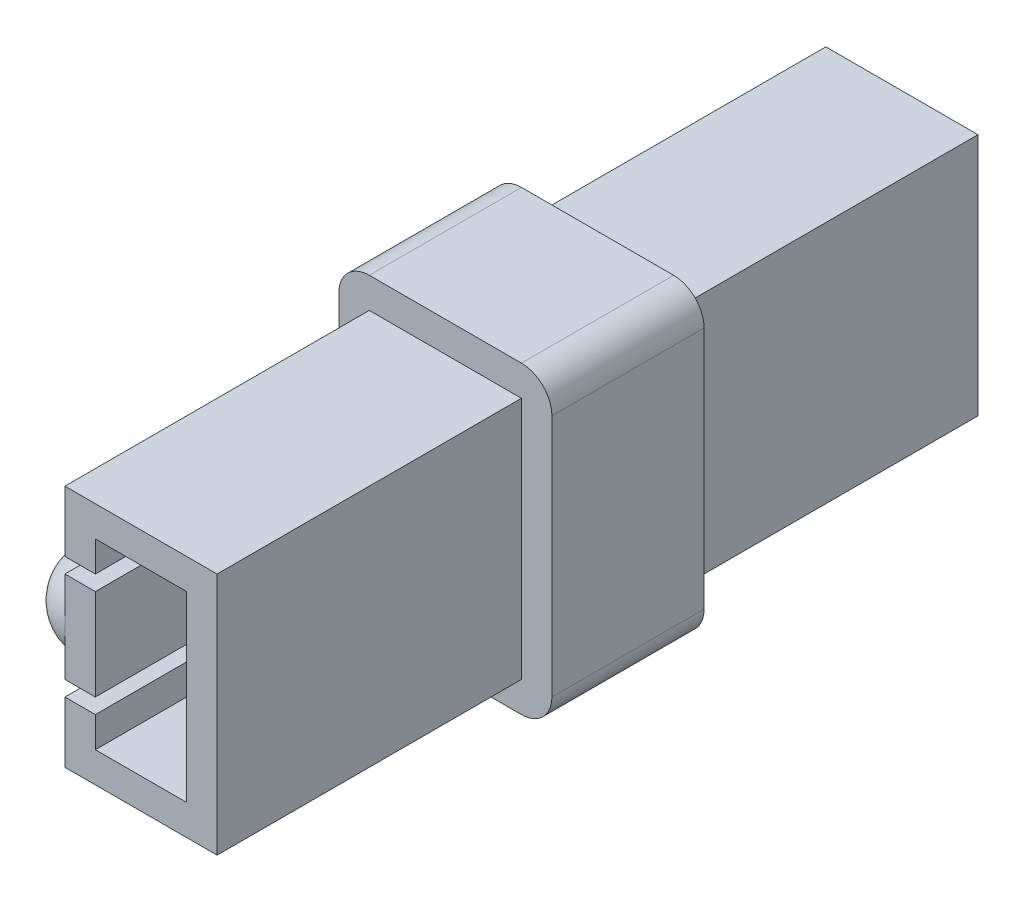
ISO-10303-21;
HEADER;
FILE_DESCRIPTION(('STEP AP214'),'2;1');
FILE_NAME('part.step','',(''),(''),'','','');
FILE_SCHEMA(('AUTOMOTIVE_DESIGN { 1 0 10303 214 1 1 1 1 }'));
ENDSEC;
DATA;
#1=APPLICATION_CONTEXT('core data for automotive mechanical design processes');
#2=APPLICATION_PROTOCOL_DEFINITION('international standard','automotive_design',2000,#1);
#3=PRODUCT_CONTEXT('',#1,'mechanical');
#4=PRODUCT('Part','Part','',(#3));
#5=PRODUCT_RELATED_PRODUCT_CATEGORY('part','',(#4));
#6=PRODUCT_DEFINITION_FORMATION('','',#4);
#7=PRODUCT_DEFINITION_CONTEXT('part definition',#1,'design');
#8=PRODUCT_DEFINITION('design','',#6,#7);
#9=PRODUCT_DEFINITION_SHAPE('','',#8);
#10=(LENGTH_UNIT() NAMED_UNIT(*) SI_UNIT(.MILLI.,.METRE.));
#11=(NAMED_UNIT(*) PLANE_ANGLE_UNIT() SI_UNIT($,.RADIAN.));
#12=(NAMED_UNIT(*) SI_UNIT($,.STERADIAN.) SOLID_ANGLE_UNIT());
#13=UNCERTAINTY_MEASURE_WITH_UNIT(LENGTH_MEASURE(1.E-05),#10,'distance_accuracy_value','');
#14=(GEOMETRIC_REPRESENTATION_CONTEXT(3) GLOBAL_UNCERTAINTY_ASSIGNED_CONTEXT((#13)) GLOBAL_UNIT_ASSIGNED_CONTEXT((#10,
#11,#12)) REPRESENTATION_CONTEXT('',''));
#15=CARTESIAN_POINT('',(0.,0.,0.));
#16=DIRECTION('',(0.,0.,1.));
#17=DIRECTION('',(1.,0.,0.));
#18=AXIS2_PLACEMENT_3D('',#15,#16,#17);
#19=CARTESIAN_POINT('',(-2.5,4.,-12.5));
#20=DIRECTION('',(0.,0.,-1.));
#21=DIRECTION('',(-1.,0.,0.));
#22=AXIS2_PLACEMENT_3D('',#19,#20,#21);
#23=PLANE('',#22);
#24=DIRECTION('',(0.,-1.,0.));
#25=VECTOR('',#24,1.);
#26=CARTESIAN_POINT('',(-1.5,-3.,-12.5));
#27=LINE('',#26,#25);
#28=CARTESIAN_POINT('',(-1.5,1.5,-12.5));
#29=VERTEX_POINT('',#28);
#30=CARTESIAN_POINT('',(-1.5,-1.5,-12.5));
#31=VERTEX_POINT('',#30);
#32=EDGE_CURVE('E346',#29,#31,#27,.T.);
#33=ORIENTED_EDGE('',*,*,#32,.T.);
#34=DIRECTION('',(-1.,0.,0.));
#35=VECTOR('',#34,1.);
#36=CARTESIAN_POINT('',(-1.5,-1.5,-12.5));
#37=LINE('',#36,#35);
#38=CARTESIAN_POINT('',(-2.5,-1.5,-12.5));
#39=VERTEX_POINT('',#38);
#40=EDGE_CURVE('E443',#31,#39,#37,.T.);
#41=ORIENTED_EDGE('',*,*,#40,.T.);
#42=DIRECTION('',(0.,-1.,0.));
#43=VECTOR('',#42,1.);
#44=CARTESIAN_POINT('',(-2.5,-4.,-12.5));
#45=LINE('',#44,#43);
#46=CARTESIAN_POINT('',(-2.5,0.,-12.5));
#47=VERTEX_POINT('',#46);
#48=EDGE_CURVE('E460',#47,#39,#45,.T.);
#49=ORIENTED_EDGE('',*,*,#48,.F.);
#50=CARTESIAN_POINT('',(-2.5,1.5,-12.5));
#51=VERTEX_POINT('',#50);
#52=EDGE_CURVE('E459',#51,#47,#45,.T.);
#53=ORIENTED_EDGE('',*,*,#52,.F.);
#54=DIRECTION('',(-1.,0.,0.));
#55=VECTOR('',#54,1.);
#56=CARTESIAN_POINT('',(-1.5,1.5,-12.5));
#57=LINE('',#56,#55);
#58=EDGE_CURVE('E441',#29,#51,#57,.T.);
#59=ORIENTED_EDGE('',*,*,#58,.F.);
#60=EDGE_LOOP('',(#33,#41,#49,#53,#59));
#61=FACE_BOUND('',#60,.T.);
#62=ADVANCED_FACE('F36',(#61),#23,.T.);
#63=CARTESIAN_POINT('',(-2.5,4.,12.5));
#64=DIRECTION('',(0.,0.,-1.));
#65=DIRECTION('',(-1.,0.,0.));
#66=AXIS2_PLACEMENT_3D('',#63,#64,#65);
#67=PLANE('',#66);
#68=DIRECTION('',(-1.,0.,0.));
#69=VECTOR('',#68,1.);
#70=CARTESIAN_POINT('',(-1.5,-1.5,12.5));
#71=LINE('',#70,#69);
#72=CARTESIAN_POINT('',(-1.5,-1.5,12.5));
#73=VERTEX_POINT('',#72);
#74=CARTESIAN_POINT('',(-2.5,-1.5,12.5));
#75=VERTEX_POINT('',#74);
#76=EDGE_CURVE('E397',#73,#75,#71,.T.);
#77=ORIENTED_EDGE('',*,*,#76,.F.);
#78=DIRECTION('',(0.,-1.,0.));
#79=VECTOR('',#78,1.);
#80=CARTESIAN_POINT('',(-1.5,-3.,12.5));
#81=LINE('',#80,#79);
#82=CARTESIAN_POINT('',(-1.5,1.5,12.5));
#83=VERTEX_POINT('',#82);
#84=EDGE_CURVE('E313',#83,#73,#81,.T.);
#85=ORIENTED_EDGE('',*,*,#84,.F.);
#86=DIRECTION('',(-1.,0.,0.));
#87=VECTOR('',#86,1.);
#88=CARTESIAN_POINT('',(-1.5,1.5,12.5));
#89=LINE('',#88,#87);
#90=CARTESIAN_POINT('',(-2.5,1.5,12.5));
#91=VERTEX_POINT('',#90);
#92=EDGE_CURVE('E401',#83,#91,#89,.T.);
#93=ORIENTED_EDGE('',*,*,#92,.T.);
#94=DIRECTION('',(0.,-1.,0.));
#95=VECTOR('',#94,1.);
#96=CARTESIAN_POINT('',(-2.5,-4.,12.5));
#97=LINE('',#96,#95);
#98=CARTESIAN_POINT('',(-2.5,0.,12.5));
#99=VERTEX_POINT('',#98);
#100=EDGE_CURVE('E474',#91,#99,#97,.T.);
#101=ORIENTED_EDGE('',*,*,#100,.T.);
#102=EDGE_CURVE('E475',#99,#75,#97,.T.);
#103=ORIENTED_EDGE('',*,*,#102,.T.);
#104=EDGE_LOOP('',(#77,#85,#93,#101,#103));
#105=FACE_BOUND('',#104,.T.);
#106=ADVANCED_FACE('F611',(#105),#67,.F.);
#107=CARTESIAN_POINT('',(-2.5,-4.,12.5));
#108=DIRECTION('',(1.,0.,0.));
#109=DIRECTION('',(0.,0.,-1.));
#110=AXIS2_PLACEMENT_3D('',#107,#108,#109);
#111=PLANE('',#110);
#112=CARTESIAN_POINT('',(-2.5,0.,11.));
#113=DIRECTION('',(1.,0.,0.));
#114=DIRECTION('',(0.,0.,1.));
#115=AXIS2_PLACEMENT_3D('',#112,#113,#114);
#116=CIRCLE('',#115,1.5);
#117=CARTESIAN_POINT('',(-2.49999999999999,-1.5,11.));
#118=VERTEX_POINT('',#117);
#119=EDGE_CURVE('E361',#99,#118,#116,.T.);
#120=ORIENTED_EDGE('',*,*,#119,.T.);
#121=DIRECTION('',(0.,0.,-1.));
#122=VECTOR('',#121,1.);
#123=CARTESIAN_POINT('',(-2.5,-1.5,12.5));
#124=LINE('',#123,#122);
#125=EDGE_CURVE('E370',#75,#118,#124,.T.);
#126=ORIENTED_EDGE('',*,*,#125,.F.);
#127=ORIENTED_EDGE('',*,*,#102,.F.);
#128=EDGE_LOOP('',(#120,#126,#127));
#129=FACE_BOUND('',#128,.T.);
#130=ADVANCED_FACE('F618',(#129),#111,.F.);
#131=CARTESIAN_POINT('',(-2.5,1.5,11.));
#132=VERTEX_POINT('',#131);
#133=EDGE_CURVE('E52',#132,#99,#116,.T.);
#134=ORIENTED_EDGE('',*,*,#133,.T.);
#135=ORIENTED_EDGE('',*,*,#100,.F.);
#136=DIRECTION('',(0.,0.,1.));
#137=VECTOR('',#136,1.);
#138=CARTESIAN_POINT('',(-2.5,1.5,2.5));
#139=LINE('',#138,#137);
#140=EDGE_CURVE('E378',#132,#91,#139,.T.);
#141=ORIENTED_EDGE('',*,*,#140,.F.);
#142=EDGE_LOOP('',(#134,#135,#141));
#143=FACE_BOUND('',#142,.T.);
#144=ADVANCED_FACE('F999',(#143),#111,.F.);
#145=EDGE_CURVE('E60',#118,#132,#116,.T.);
#146=ORIENTED_EDGE('',*,*,#145,.T.);
#147=CARTESIAN_POINT('',(-2.5,1.5,2.5));
#148=VERTEX_POINT('',#147);
#149=EDGE_CURVE('E379',#148,#132,#139,.T.);
#150=ORIENTED_EDGE('',*,*,#149,.F.);
#151=DIRECTION('',(0.,-1.,0.));
#152=VECTOR('',#151,1.);
#153=CARTESIAN_POINT('',(-2.5,5.,2.5));
#154=LINE('',#153,#152);
#155=CARTESIAN_POINT('',(-2.5,-1.5,2.5));
#156=VERTEX_POINT('',#155);
#157=EDGE_CURVE('E516',#148,#156,#154,.T.);
#158=ORIENTED_EDGE('',*,*,#157,.T.);
#159=EDGE_CURVE('E368',#118,#156,#124,.T.);
#160=ORIENTED_EDGE('',*,*,#159,.F.);
#161=EDGE_LOOP('',(#146,#150,#158,#160));
#162=FACE_BOUND('',#161,.T.);
#163=ADVANCED_FACE('F624',(#162),#111,.F.);
#164=CARTESIAN_POINT('',(-2.5,0.,-11.));
#165=DIRECTION('',(1.,0.,0.));
#166=DIRECTION('',(0.,0.,-1.));
#167=AXIS2_PLACEMENT_3D('',#164,#165,#166);
#168=CIRCLE('',#167,1.5);
#169=CARTESIAN_POINT('',(-2.5,-1.5,-11.));
#170=VERTEX_POINT('',#169);
#171=EDGE_CURVE('E365',#170,#47,#168,.T.);
#172=ORIENTED_EDGE('',*,*,#171,.T.);
#173=ORIENTED_EDGE('',*,*,#48,.T.);
#174=DIRECTION('',(0.,0.,-1.));
#175=VECTOR('',#174,1.);
#176=CARTESIAN_POINT('',(-2.5,-1.5,-12.5));
#177=LINE('',#176,#175);
#178=EDGE_CURVE('E400',#170,#39,#177,.T.);
#179=ORIENTED_EDGE('',*,*,#178,.F.);
#180=EDGE_LOOP('',(#172,#173,#179));
#181=FACE_BOUND('',#180,.T.);
#182=ADVANCED_FACE('F682',(#181),#111,.F.);
#183=CARTESIAN_POINT('',(-2.5,1.5,-11.));
#184=VERTEX_POINT('',#183);
#185=EDGE_CURVE('E369',#184,#170,#168,.T.);
#186=ORIENTED_EDGE('',*,*,#185,.T.);
#187=CARTESIAN_POINT('',(-2.5,-1.5,-2.5));
#188=VERTEX_POINT('',#187);
#189=EDGE_CURVE('E413',#188,#170,#177,.T.);
#190=ORIENTED_EDGE('',*,*,#189,.F.);
#191=DIRECTION('',(0.,-1.,0.));
#192=VECTOR('',#191,1.);
#193=CARTESIAN_POINT('',(-2.5,5.,-2.5));
#194=LINE('',#193,#192);
#195=CARTESIAN_POINT('',(-2.5,1.5,-2.5));
#196=VERTEX_POINT('',#195);
#197=EDGE_CURVE('E556',#196,#188,#194,.T.);
#198=ORIENTED_EDGE('',*,*,#197,.F.);
#199=DIRECTION('',(0.,0.,1.));
#200=VECTOR('',#199,1.);
#201=CARTESIAN_POINT('',(-2.5,1.5,-2.5));
#202=LINE('',#201,#200);
#203=EDGE_CURVE('E416',#184,#196,#202,.T.);
#204=ORIENTED_EDGE('',*,*,#203,.F.);
#205=EDGE_LOOP('',(#186,#190,#198,#204));
#206=FACE_BOUND('',#205,.T.);
#207=ADVANCED_FACE('F711',(#206),#111,.F.);
#208=EDGE_CURVE('E366',#47,#184,#168,.T.);
#209=ORIENTED_EDGE('',*,*,#208,.T.);
#210=EDGE_CURVE('E417',#51,#184,#202,.T.);
#211=ORIENTED_EDGE('',*,*,#210,.F.);
#212=ORIENTED_EDGE('',*,*,#52,.T.);
#213=EDGE_LOOP('',(#209,#211,#212));
#214=FACE_BOUND('',#213,.T.);
#215=ADVANCED_FACE('F717',(#214),#111,.F.);
#216=CARTESIAN_POINT('',(-2.5,4.,2.5));
#217=VERTEX_POINT('',#216);
#218=CARTESIAN_POINT('',(-2.5,2.,2.5));
#219=VERTEX_POINT('',#218);
#220=EDGE_CURVE('E512',#217,#219,#154,.T.);
#221=ORIENTED_EDGE('',*,*,#220,.T.);
#222=DIRECTION('',(0.,0.,-1.));
#223=VECTOR('',#222,1.);
#224=CARTESIAN_POINT('',(-2.5,2.,13.5));
#225=LINE('',#224,#223);
#226=CARTESIAN_POINT('',(-2.5,2.,12.5));
#227=VERTEX_POINT('',#226);
#228=EDGE_CURVE('E376',#227,#219,#225,.T.);
#229=ORIENTED_EDGE('',*,*,#228,.F.);
#230=CARTESIAN_POINT('',(-2.5,4.,12.5));
#231=VERTEX_POINT('',#230);
#232=EDGE_CURVE('E470',#231,#227,#97,.T.);
#233=ORIENTED_EDGE('',*,*,#232,.F.);
#234=DIRECTION('',(0.,0.,-1.));
#235=VECTOR('',#234,1.);
#236=CARTESIAN_POINT('',(-2.5,4.,12.5));
#237=LINE('',#236,#235);
#238=EDGE_CURVE('E485',#231,#217,#237,.T.);
#239=ORIENTED_EDGE('',*,*,#238,.T.);
#240=EDGE_LOOP('',(#221,#229,#233,#239));
#241=FACE_BOUND('',#240,.T.);
#242=ADVANCED_FACE('F647',(#241),#111,.F.);
#243=CARTESIAN_POINT('',(-2.5,4.,-12.5));
#244=VERTEX_POINT('',#243);
#245=CARTESIAN_POINT('',(-2.5,2.,-12.5));
#246=VERTEX_POINT('',#245);
#247=EDGE_CURVE('E455',#244,#246,#45,.T.);
#248=ORIENTED_EDGE('',*,*,#247,.T.);
#249=DIRECTION('',(0.,0.,-1.));
#250=VECTOR('',#249,1.);
#251=CARTESIAN_POINT('',(-2.5,2.,-13.5));
#252=LINE('',#251,#250);
#253=CARTESIAN_POINT('',(-2.5,2.,-2.5));
#254=VERTEX_POINT('',#253);
#255=EDGE_CURVE('E420',#254,#246,#252,.T.);
#256=ORIENTED_EDGE('',*,*,#255,.F.);
#257=CARTESIAN_POINT('',(-2.5,4.,-2.5));
#258=VERTEX_POINT('',#257);
#259=EDGE_CURVE('E552',#258,#254,#194,.T.);
#260=ORIENTED_EDGE('',*,*,#259,.F.);
#261=EDGE_CURVE('E484',#258,#244,#237,.T.);
#262=ORIENTED_EDGE('',*,*,#261,.T.);
#263=EDGE_LOOP('',(#248,#256,#260,#262));
#264=FACE_BOUND('',#263,.T.);
#265=ADVANCED_FACE('F728',(#264),#111,.F.);
#266=CARTESIAN_POINT('',(-3.5,5.,2.5));
#267=DIRECTION('',(0.,0.,-1.));
#268=DIRECTION('',(-1.,0.,0.));
#269=AXIS2_PLACEMENT_3D('',#266,#267,#268);
#270=PLANE('',#269);
#271=DIRECTION('',(0.,-1.,0.));
#272=VECTOR('',#271,1.);
#273=CARTESIAN_POINT('',(-3.5,-5.,2.5));
#274=LINE('',#273,#272);
#275=CARTESIAN_POINT('',(-3.5,4.,2.5));
#276=VERTEX_POINT('',#275);
#277=CARTESIAN_POINT('',(-3.5,-4.,2.5));
#278=VERTEX_POINT('',#277);
#279=EDGE_CURVE('E528',#276,#278,#274,.T.);
#280=ORIENTED_EDGE('',*,*,#279,.T.);
#281=CARTESIAN_POINT('',(-2.5,-4.,2.5));
#282=DIRECTION('',(0.,0.,-1.));
#283=DIRECTION('',(-1.,0.,0.));
#284=AXIS2_PLACEMENT_3D('',#281,#282,#283);
#285=CIRCLE('',#284,1.);
#286=CARTESIAN_POINT('',(-2.5,-5.,2.5));
#287=VERTEX_POINT('',#286);
#288=EDGE_CURVE('E581',#278,#287,#285,.F.);
#289=ORIENTED_EDGE('',*,*,#288,.T.);
#290=DIRECTION('',(1.,0.,0.));
#291=VECTOR('',#290,1.);
#292=CARTESIAN_POINT('',(-3.5,-5.,2.5));
#293=LINE('',#292,#291);
#294=CARTESIAN_POINT('',(2.5,-5.,2.5));
#295=VERTEX_POINT('',#294);
#296=EDGE_CURVE('E531',#287,#295,#293,.T.);
#297=ORIENTED_EDGE('',*,*,#296,.T.);
#298=CARTESIAN_POINT('',(2.5,-4.,2.5));
#299=DIRECTION('',(0.,0.,-1.));
#300=DIRECTION('',(-1.,0.,0.));
#301=AXIS2_PLACEMENT_3D('',#298,#299,#300);
#302=CIRCLE('',#301,1.);
#303=CARTESIAN_POINT('',(3.5,-4.,2.5));
#304=VERTEX_POINT('',#303);
#305=EDGE_CURVE('E579',#295,#304,#302,.F.);
#306=ORIENTED_EDGE('',*,*,#305,.T.);
#307=DIRECTION('',(0.,1.,0.));
#308=VECTOR('',#307,1.);
#309=CARTESIAN_POINT('',(3.5,-5.,2.5));
#310=LINE('',#309,#308);
#311=CARTESIAN_POINT('',(3.5,4.,2.5));
#312=VERTEX_POINT('',#311);
#313=EDGE_CURVE('E534',#304,#312,#310,.T.);
#314=ORIENTED_EDGE('',*,*,#313,.T.);
#315=CARTESIAN_POINT('',(2.5,4.,2.5));
#316=DIRECTION('',(0.,0.,-1.));
#317=DIRECTION('',(-1.,0.,0.));
#318=AXIS2_PLACEMENT_3D('',#315,#316,#317);
#319=CIRCLE('',#318,1.);
#320=CARTESIAN_POINT('',(2.5,5.,2.5));
#321=VERTEX_POINT('',#320);
#322=EDGE_CURVE('E574',#312,#321,#319,.F.);
#323=ORIENTED_EDGE('',*,*,#322,.T.);
#324=DIRECTION('',(-1.,0.,0.));
#325=VECTOR('',#324,1.);
#326=CARTESIAN_POINT('',(-3.5,5.,2.5));
#327=LINE('',#326,#325);
#328=CARTESIAN_POINT('',(-2.5,5.,2.5));
#329=VERTEX_POINT('',#328);
#330=EDGE_CURVE('E538',#321,#329,#327,.T.);
#331=ORIENTED_EDGE('',*,*,#330,.T.);
#332=CARTESIAN_POINT('',(-2.5,4.,2.5));
#333=DIRECTION('',(0.,0.,-1.));
#334=DIRECTION('',(-1.,0.,0.));
#335=AXIS2_PLACEMENT_3D('',#332,#333,#334);
#336=CIRCLE('',#335,1.);
#337=EDGE_CURVE('E577',#329,#276,#336,.F.);
#338=ORIENTED_EDGE('',*,*,#337,.T.);
#339=EDGE_LOOP('',(#280,#289,#297,#306,#314,#323,#331,#338));
#340=FACE_BOUND('',#339,.T.);
#341=ORIENTED_EDGE('',*,*,#220,.F.);
#342=DIRECTION('',(-1.,0.,0.));
#343=VECTOR('',#342,1.);
#344=CARTESIAN_POINT('',(-3.5,4.,2.5));
#345=LINE('',#344,#343);
#346=CARTESIAN_POINT('',(2.5,4.,2.5));
#347=VERTEX_POINT('',#346);
#348=EDGE_CURVE('E502',#347,#217,#345,.T.);
#349=ORIENTED_EDGE('',*,*,#348,.F.);
#350=DIRECTION('',(0.,1.,0.));
#351=VECTOR('',#350,1.);
#352=CARTESIAN_POINT('',(2.5,5.,2.5));
#353=LINE('',#352,#351);
#354=CARTESIAN_POINT('',(2.5,-4.,2.5));
#355=VERTEX_POINT('',#354);
#356=EDGE_CURVE('E505',#355,#347,#353,.T.);
#357=ORIENTED_EDGE('',*,*,#356,.F.);
#358=DIRECTION('',(1.,0.,0.));
#359=VECTOR('',#358,1.);
#360=CARTESIAN_POINT('',(-3.5,-4.,2.5));
#361=LINE('',#360,#359);
#362=CARTESIAN_POINT('',(-2.5,-4.,2.5));
#363=VERTEX_POINT('',#362);
#364=EDGE_CURVE('E508',#363,#355,#361,.T.);
#365=ORIENTED_EDGE('',*,*,#364,.F.);
#366=CARTESIAN_POINT('',(-2.5,-2.,2.5));
#367=VERTEX_POINT('',#366);
#368=EDGE_CURVE('E511',#367,#363,#154,.T.);
#369=ORIENTED_EDGE('',*,*,#368,.F.);
#370=DIRECTION('',(-1.,0.,0.));
#371=VECTOR('',#370,1.);
#372=CARTESIAN_POINT('',(-1.5,-2.,2.5));
#373=LINE('',#372,#371);
#374=CARTESIAN_POINT('',(-1.5,-2.,2.5));
#375=VERTEX_POINT('',#374);
#376=EDGE_CURVE('E409',#375,#367,#373,.T.);
#377=ORIENTED_EDGE('',*,*,#376,.F.);
#378=DIRECTION('',(0.,-1.,0.));
#379=VECTOR('',#378,1.);
#380=CARTESIAN_POINT('',(-1.5,-1.5,2.5));
#381=LINE('',#380,#379);
#382=CARTESIAN_POINT('',(-1.5,-1.5,2.5));
#383=VERTEX_POINT('',#382);
#384=EDGE_CURVE('E385',#383,#375,#381,.T.);
#385=ORIENTED_EDGE('',*,*,#384,.F.);
#386=DIRECTION('',(-1.,0.,0.));
#387=VECTOR('',#386,1.);
#388=CARTESIAN_POINT('',(-1.5,-1.5,2.5));
#389=LINE('',#388,#387);
#390=EDGE_CURVE('E396',#383,#156,#389,.T.);
#391=ORIENTED_EDGE('',*,*,#390,.T.);
#392=ORIENTED_EDGE('',*,*,#157,.F.);
#393=DIRECTION('',(-1.,0.,0.));
#394=VECTOR('',#393,1.);
#395=CARTESIAN_POINT('',(-1.5,1.5,2.5));
#396=LINE('',#395,#394);
#397=CARTESIAN_POINT('',(-1.5,1.5,2.5));
#398=VERTEX_POINT('',#397);
#399=EDGE_CURVE('E404',#398,#148,#396,.T.);
#400=ORIENTED_EDGE('',*,*,#399,.F.);
#401=DIRECTION('',(0.,-1.,0.));
#402=VECTOR('',#401,1.);
#403=CARTESIAN_POINT('',(-1.5,2.,2.5));
#404=LINE('',#403,#402);
#405=CARTESIAN_POINT('',(-1.5,2.,2.5));
#406=VERTEX_POINT('',#405);
#407=EDGE_CURVE('E392',#406,#398,#404,.T.);
#408=ORIENTED_EDGE('',*,*,#407,.F.);
#409=DIRECTION('',(-1.,0.,0.));
#410=VECTOR('',#409,1.);
#411=CARTESIAN_POINT('',(-1.5,2.,2.5));
#412=LINE('',#411,#410);
#413=EDGE_CURVE('E406',#406,#219,#412,.T.);
#414=ORIENTED_EDGE('',*,*,#413,.T.);
#415=EDGE_LOOP('',(#341,#349,#357,#365,#369,#377,#385,#391,#392,#400,#408,#414));
#416=FACE_BOUND('',#415,.T.);
#417=ADVANCED_FACE('F632',(#340,#416),#270,.F.);
#418=CARTESIAN_POINT('',(-3.5,5.,-2.5));
#419=DIRECTION('',(0.,0.,-1.));
#420=DIRECTION('',(-1.,0.,0.));
#421=AXIS2_PLACEMENT_3D('',#418,#419,#420);
#422=PLANE('',#421);
#423=DIRECTION('',(1.,0.,0.));
#424=VECTOR('',#423,1.);
#425=CARTESIAN_POINT('',(-3.5,-5.,-2.5));
#426=LINE('',#425,#424);
#427=CARTESIAN_POINT('',(-2.5,-5.,-2.5));
#428=VERTEX_POINT('',#427);
#429=CARTESIAN_POINT('',(2.5,-5.,-2.5));
#430=VERTEX_POINT('',#429);
#431=EDGE_CURVE('E519',#428,#430,#426,.T.);
#432=ORIENTED_EDGE('',*,*,#431,.F.);
#433=CARTESIAN_POINT('',(-2.5,-4.,-2.5));
#434=DIRECTION('',(0.,0.,-1.));
#435=DIRECTION('',(-1.,0.,0.));
#436=AXIS2_PLACEMENT_3D('',#433,#434,#435);
#437=CIRCLE('',#436,1.);
#438=CARTESIAN_POINT('',(-3.5,-4.,-2.5));
#439=VERTEX_POINT('',#438);
#440=EDGE_CURVE('E567',#428,#439,#437,.T.);
#441=ORIENTED_EDGE('',*,*,#440,.T.);
#442=DIRECTION('',(0.,-1.,0.));
#443=VECTOR('',#442,1.);
#444=CARTESIAN_POINT('',(-3.5,-5.,-2.5));
#445=LINE('',#444,#443);
#446=CARTESIAN_POINT('',(-3.5,4.,-2.5));
#447=VERTEX_POINT('',#446);
#448=EDGE_CURVE('E515',#447,#439,#445,.T.);
#449=ORIENTED_EDGE('',*,*,#448,.F.);
#450=CARTESIAN_POINT('',(-2.5,4.,-2.5));
#451=DIRECTION('',(0.,0.,-1.));
#452=DIRECTION('',(-1.,0.,0.));
#453=AXIS2_PLACEMENT_3D('',#450,#451,#452);
#454=CIRCLE('',#453,1.);
#455=CARTESIAN_POINT('',(-2.5,5.,-2.5));
#456=VERTEX_POINT('',#455);
#457=EDGE_CURVE('E563',#447,#456,#454,.T.);
#458=ORIENTED_EDGE('',*,*,#457,.T.);
#459=DIRECTION('',(-1.,0.,0.));
#460=VECTOR('',#459,1.);
#461=CARTESIAN_POINT('',(-3.5,5.,-2.5));
#462=LINE('',#461,#460);
#463=CARTESIAN_POINT('',(2.5,5.,-2.5));
#464=VERTEX_POINT('',#463);
#465=EDGE_CURVE('E525',#464,#456,#462,.T.);
#466=ORIENTED_EDGE('',*,*,#465,.F.);
#467=CARTESIAN_POINT('',(2.5,4.,-2.5));
#468=DIRECTION('',(0.,0.,-1.));
#469=DIRECTION('',(-1.,0.,0.));
#470=AXIS2_PLACEMENT_3D('',#467,#468,#469);
#471=CIRCLE('',#470,1.);
#472=CARTESIAN_POINT('',(3.5,4.,-2.5));
#473=VERTEX_POINT('',#472);
#474=EDGE_CURVE('E561',#464,#473,#471,.T.);
#475=ORIENTED_EDGE('',*,*,#474,.T.);
#476=DIRECTION('',(0.,1.,0.));
#477=VECTOR('',#476,1.);
#478=CARTESIAN_POINT('',(3.5,-5.,-2.5));
#479=LINE('',#478,#477);
#480=CARTESIAN_POINT('',(3.5,-4.,-2.5));
#481=VERTEX_POINT('',#480);
#482=EDGE_CURVE('E522',#481,#473,#479,.T.);
#483=ORIENTED_EDGE('',*,*,#482,.F.);
#484=CARTESIAN_POINT('',(2.5,-4.,-2.5));
#485=DIRECTION('',(0.,0.,-1.));
#486=DIRECTION('',(-1.,0.,0.));
#487=AXIS2_PLACEMENT_3D('',#484,#485,#486);
#488=CIRCLE('',#487,1.);
#489=EDGE_CURVE('E565',#481,#430,#488,.T.);
#490=ORIENTED_EDGE('',*,*,#489,.T.);
#491=EDGE_LOOP('',(#432,#441,#449,#458,#466,#475,#483,#490));
#492=FACE_BOUND('',#491,.T.);
#493=DIRECTION('',(-1.,0.,0.));
#494=VECTOR('',#493,1.);
#495=CARTESIAN_POINT('',(-3.5,4.,-2.5));
#496=LINE('',#495,#494);
#497=CARTESIAN_POINT('',(2.5,4.,-2.5));
#498=VERTEX_POINT('',#497);
#499=EDGE_CURVE('E542',#498,#258,#496,.T.);
#500=ORIENTED_EDGE('',*,*,#499,.T.);
#501=ORIENTED_EDGE('',*,*,#259,.T.);
#502=DIRECTION('',(-1.,0.,0.));
#503=VECTOR('',#502,1.);
#504=CARTESIAN_POINT('',(-1.5,2.,-2.5));
#505=LINE('',#504,#503);
#506=CARTESIAN_POINT('',(-1.5,2.,-2.5));
#507=VERTEX_POINT('',#506);
#508=EDGE_CURVE('E435',#507,#254,#505,.T.);
#509=ORIENTED_EDGE('',*,*,#508,.F.);
#510=DIRECTION('',(0.,1.,0.));
#511=VECTOR('',#510,1.);
#512=CARTESIAN_POINT('',(-1.5,2.,-2.5));
#513=LINE('',#512,#511);
#514=CARTESIAN_POINT('',(-1.5,1.5,-2.5));
#515=VERTEX_POINT('',#514);
#516=EDGE_CURVE('E430',#515,#507,#513,.T.);
#517=ORIENTED_EDGE('',*,*,#516,.F.);
#518=DIRECTION('',(-1.,0.,0.));
#519=VECTOR('',#518,1.);
#520=CARTESIAN_POINT('',(-1.5,1.5,-2.5));
#521=LINE('',#520,#519);
#522=EDGE_CURVE('E438',#515,#196,#521,.T.);
#523=ORIENTED_EDGE('',*,*,#522,.T.);
#524=ORIENTED_EDGE('',*,*,#197,.T.);
#525=DIRECTION('',(-1.,0.,0.));
#526=VECTOR('',#525,1.);
#527=CARTESIAN_POINT('',(-1.5,-1.5,-2.5));
#528=LINE('',#527,#526);
#529=CARTESIAN_POINT('',(-1.5,-1.5,-2.5));
#530=VERTEX_POINT('',#529);
#531=EDGE_CURVE('E446',#530,#188,#528,.T.);
#532=ORIENTED_EDGE('',*,*,#531,.F.);
#533=DIRECTION('',(0.,1.,0.));
#534=VECTOR('',#533,1.);
#535=CARTESIAN_POINT('',(-1.5,-1.5,-2.5));
#536=LINE('',#535,#534);
#537=CARTESIAN_POINT('',(-1.5,-2.,-2.5));
#538=VERTEX_POINT('',#537);
#539=EDGE_CURVE('E424',#538,#530,#536,.T.);
#540=ORIENTED_EDGE('',*,*,#539,.F.);
#541=DIRECTION('',(-1.,0.,0.));
#542=VECTOR('',#541,1.);
#543=CARTESIAN_POINT('',(-1.5,-2.,-2.5));
#544=LINE('',#543,#542);
#545=CARTESIAN_POINT('',(-2.5,-2.,-2.5));
#546=VERTEX_POINT('',#545);
#547=EDGE_CURVE('E434',#538,#546,#544,.T.);
#548=ORIENTED_EDGE('',*,*,#547,.T.);
#549=CARTESIAN_POINT('',(-2.5,-4.,-2.5));
#550=VERTEX_POINT('',#549);
#551=EDGE_CURVE('E551',#546,#550,#194,.T.);
#552=ORIENTED_EDGE('',*,*,#551,.T.);
#553=DIRECTION('',(1.,0.,0.));
#554=VECTOR('',#553,1.);
#555=CARTESIAN_POINT('',(-3.5,-4.,-2.5));
#556=LINE('',#555,#554);
#557=CARTESIAN_POINT('',(2.5,-4.,-2.5));
#558=VERTEX_POINT('',#557);
#559=EDGE_CURVE('E548',#550,#558,#556,.T.);
#560=ORIENTED_EDGE('',*,*,#559,.T.);
#561=DIRECTION('',(0.,1.,0.));
#562=VECTOR('',#561,1.);
#563=CARTESIAN_POINT('',(2.5,5.,-2.5));
#564=LINE('',#563,#562);
#565=EDGE_CURVE('E545',#558,#498,#564,.T.);
#566=ORIENTED_EDGE('',*,*,#565,.T.);
#567=EDGE_LOOP('',(#500,#501,#509,#517,#523,#524,#532,#540,#548,#552,#560,#566));
#568=FACE_BOUND('',#567,.T.);
#569=ADVANCED_FACE('F701',(#492,#568),#422,.T.);
#570=CARTESIAN_POINT('',(-3.5,-5.,2.5));
#571=DIRECTION('',(1.,0.,0.));
#572=DIRECTION('',(0.,0.,-1.));
#573=AXIS2_PLACEMENT_3D('',#570,#571,#572);
#574=PLANE('',#573);
#575=ORIENTED_EDGE('',*,*,#448,.T.);
#576=DIRECTION('',(0.,0.,-1.));
#577=VECTOR('',#576,1.);
#578=CARTESIAN_POINT('',(-3.5,-4.,2.5));
#579=LINE('',#578,#577);
#580=EDGE_CURVE('E572',#439,#278,#579,.F.);
#581=ORIENTED_EDGE('',*,*,#580,.T.);
#582=ORIENTED_EDGE('',*,*,#279,.F.);
#583=DIRECTION('',(0.,0.,-1.));
#584=VECTOR('',#583,1.);
#585=CARTESIAN_POINT('',(-3.5,4.,2.5));
#586=LINE('',#585,#584);
#587=EDGE_CURVE('E569',#276,#447,#586,.T.);
#588=ORIENTED_EDGE('',*,*,#587,.T.);
#589=EDGE_LOOP('',(#575,#581,#582,#588));
#590=FACE_BOUND('',#589,.T.);
#591=ADVANCED_FACE('F38',(#590),#574,.F.);
#592=CARTESIAN_POINT('',(-3.5,-5.,2.5));
#593=DIRECTION('',(0.,1.,0.));
#594=DIRECTION('',(0.,0.,1.));
#595=AXIS2_PLACEMENT_3D('',#592,#593,#594);
#596=PLANE('',#595);
#597=ORIENTED_EDGE('',*,*,#296,.F.);
#598=DIRECTION('',(0.,0.,-1.));
#599=VECTOR('',#598,1.);
#600=CARTESIAN_POINT('',(-2.5,-5.,2.5));
#601=LINE('',#600,#599);
#602=EDGE_CURVE('E558',#287,#428,#601,.T.);
#603=ORIENTED_EDGE('',*,*,#602,.T.);
#604=ORIENTED_EDGE('',*,*,#431,.T.);
#605=DIRECTION('',(0.,0.,-1.));
#606=VECTOR('',#605,1.);
#607=CARTESIAN_POINT('',(2.5,-5.,2.5));
#608=LINE('',#607,#606);
#609=EDGE_CURVE('E555',#430,#295,#608,.F.);
#610=ORIENTED_EDGE('',*,*,#609,.T.);
#611=EDGE_LOOP('',(#597,#603,#604,#610));
#612=FACE_BOUND('',#611,.T.);
#613=ADVANCED_FACE('F768',(#612),#596,.F.);
#614=CARTESIAN_POINT('',(3.5,-5.,2.5));
#615=DIRECTION('',(-1.,0.,0.));
#616=DIRECTION('',(0.,0.,1.));
#617=AXIS2_PLACEMENT_3D('',#614,#615,#616);
#618=PLANE('',#617);
#619=ORIENTED_EDGE('',*,*,#313,.F.);
#620=DIRECTION('',(0.,0.,-1.));
#621=VECTOR('',#620,1.);
#622=CARTESIAN_POINT('',(3.5,-4.,2.5));
#623=LINE('',#622,#621);
#624=EDGE_CURVE('E586',#304,#481,#623,.T.);
#625=ORIENTED_EDGE('',*,*,#624,.T.);
#626=ORIENTED_EDGE('',*,*,#482,.T.);
#627=DIRECTION('',(0.,0.,-1.));
#628=VECTOR('',#627,1.);
#629=CARTESIAN_POINT('',(3.5,4.,2.5));
#630=LINE('',#629,#628);
#631=EDGE_CURVE('E583',#473,#312,#630,.F.);
#632=ORIENTED_EDGE('',*,*,#631,.T.);
#633=EDGE_LOOP('',(#619,#625,#626,#632));
#634=FACE_BOUND('',#633,.T.);
#635=ADVANCED_FACE('F775',(#634),#618,.F.);
#636=CARTESIAN_POINT('',(-3.5,5.,2.5));
#637=DIRECTION('',(0.,-1.,0.));
#638=DIRECTION('',(0.,0.,-1.));
#639=AXIS2_PLACEMENT_3D('',#636,#637,#638);
#640=PLANE('',#639);
#641=ORIENTED_EDGE('',*,*,#465,.T.);
#642=DIRECTION('',(0.,0.,-1.));
#643=VECTOR('',#642,1.);
#644=CARTESIAN_POINT('',(-2.5,5.,2.5));
#645=LINE('',#644,#643);
#646=EDGE_CURVE('E593',#456,#329,#645,.F.);
#647=ORIENTED_EDGE('',*,*,#646,.T.);
#648=ORIENTED_EDGE('',*,*,#330,.F.);
#649=DIRECTION('',(0.,0.,-1.));
#650=VECTOR('',#649,1.);
#651=CARTESIAN_POINT('',(2.5,5.,2.5));
#652=LINE('',#651,#650);
#653=EDGE_CURVE('E589',#321,#464,#652,.T.);
#654=ORIENTED_EDGE('',*,*,#653,.T.);
#655=EDGE_LOOP('',(#641,#647,#648,#654));
#656=FACE_BOUND('',#655,.T.);
#657=ADVANCED_FACE('F738',(#656),#640,.F.);
#658=CARTESIAN_POINT('',(-1.5,-2.,-12.5));
#659=VERTEX_POINT('',#658);
#660=CARTESIAN_POINT('',(-1.5,-3.,-12.5));
#661=VERTEX_POINT('',#660);
#662=EDGE_CURVE('E342',#659,#661,#27,.T.);
#663=ORIENTED_EDGE('',*,*,#662,.T.);
#664=DIRECTION('',(1.,0.,0.));
#665=VECTOR('',#664,1.);
#666=CARTESIAN_POINT('',(-1.5,-3.,-12.5));
#667=LINE('',#666,#665);
#668=CARTESIAN_POINT('',(1.5,-3.,-12.5));
#669=VERTEX_POINT('',#668);
#670=EDGE_CURVE('E322',#661,#669,#667,.T.);
#671=ORIENTED_EDGE('',*,*,#670,.T.);
#672=DIRECTION('',(0.,1.,0.));
#673=VECTOR('',#672,1.);
#674=CARTESIAN_POINT('',(1.5,-3.,-12.5));
#675=LINE('',#674,#673);
#676=CARTESIAN_POINT('',(1.5,3.,-12.5));
#677=VERTEX_POINT('',#676);
#678=EDGE_CURVE('E348',#669,#677,#675,.T.);
#679=ORIENTED_EDGE('',*,*,#678,.T.);
#680=DIRECTION('',(-1.,0.,0.));
#681=VECTOR('',#680,1.);
#682=CARTESIAN_POINT('',(-1.5,3.,-12.5));
#683=LINE('',#682,#681);
#684=CARTESIAN_POINT('',(-1.5,3.,-12.5));
#685=VERTEX_POINT('',#684);
#686=EDGE_CURVE('E326',#677,#685,#683,.T.);
#687=ORIENTED_EDGE('',*,*,#686,.T.);
#688=CARTESIAN_POINT('',(-1.5,2.,-12.5));
#689=VERTEX_POINT('',#688);
#690=EDGE_CURVE('E343',#685,#689,#27,.T.);
#691=ORIENTED_EDGE('',*,*,#690,.T.);
#692=DIRECTION('',(1.,0.,0.));
#693=VECTOR('',#692,1.);
#694=CARTESIAN_POINT('',(-2.5,2.,-12.5));
#695=LINE('',#694,#693);
#696=EDGE_CURVE('E451',#246,#689,#695,.T.);
#697=ORIENTED_EDGE('',*,*,#696,.F.);
#698=ORIENTED_EDGE('',*,*,#247,.F.);
#699=DIRECTION('',(-1.,0.,0.));
#700=VECTOR('',#699,1.);
#701=CARTESIAN_POINT('',(-2.5,4.,-12.5));
#702=LINE('',#701,#700);
#703=CARTESIAN_POINT('',(2.5,4.,-12.5));
#704=VERTEX_POINT('',#703);
#705=EDGE_CURVE('E466',#704,#244,#702,.T.);
#706=ORIENTED_EDGE('',*,*,#705,.F.);
#707=DIRECTION('',(0.,1.,0.));
#708=VECTOR('',#707,1.);
#709=CARTESIAN_POINT('',(2.5,-4.,-12.5));
#710=LINE('',#709,#708);
#711=CARTESIAN_POINT('',(2.5,-4.,-12.5));
#712=VERTEX_POINT('',#711);
#713=EDGE_CURVE('E463',#712,#704,#710,.T.);
#714=ORIENTED_EDGE('',*,*,#713,.F.);
#715=DIRECTION('',(1.,0.,0.));
#716=VECTOR('',#715,1.);
#717=CARTESIAN_POINT('',(-2.5,-4.,-12.5));
#718=LINE('',#717,#716);
#719=CARTESIAN_POINT('',(-2.5,-4.,-12.5));
#720=VERTEX_POINT('',#719);
#721=EDGE_CURVE('E458',#720,#712,#718,.T.);
#722=ORIENTED_EDGE('',*,*,#721,.F.);
#723=CARTESIAN_POINT('',(-2.5,-2.,-12.5));
#724=VERTEX_POINT('',#723);
#725=EDGE_CURVE('E454',#724,#720,#45,.T.);
#726=ORIENTED_EDGE('',*,*,#725,.F.);
#727=DIRECTION('',(-1.,0.,0.));
#728=VECTOR('',#727,1.);
#729=CARTESIAN_POINT('',(-2.5,-2.,-12.5));
#730=LINE('',#729,#728);
#731=EDGE_CURVE('E437',#659,#724,#730,.T.);
#732=ORIENTED_EDGE('',*,*,#731,.F.);
#733=EDGE_LOOP('',(#663,#671,#679,#687,#691,#697,#698,#706,#714,#722,#726,#732));
#734=FACE_BOUND('',#733,.T.);
#735=ADVANCED_FACE('F662',(#734),#23,.T.);
#736=CARTESIAN_POINT('',(-2.5,4.,12.5));
#737=DIRECTION('',(0.,-1.,0.));
#738=DIRECTION('',(0.,0.,-1.));
#739=AXIS2_PLACEMENT_3D('',#736,#737,#738);
#740=PLANE('',#739);
#741=ORIENTED_EDGE('',*,*,#499,.F.);
#742=DIRECTION('',(0.,0.,-1.));
#743=VECTOR('',#742,1.);
#744=CARTESIAN_POINT('',(2.5,4.,12.5));
#745=LINE('',#744,#743);
#746=EDGE_CURVE('E488',#498,#704,#745,.T.);
#747=ORIENTED_EDGE('',*,*,#746,.T.);
#748=ORIENTED_EDGE('',*,*,#705,.T.);
#749=ORIENTED_EDGE('',*,*,#261,.F.);
#750=EDGE_LOOP('',(#741,#747,#748,#749));
#751=FACE_BOUND('',#750,.T.);
#752=ADVANCED_FACE('F730',(#751),#740,.F.);
#753=CARTESIAN_POINT('',(2.5,-4.,12.5));
#754=DIRECTION('',(-1.,0.,0.));
#755=DIRECTION('',(0.,-1.,0.));
#756=AXIS2_PLACEMENT_3D('',#753,#754,#755);
#757=PLANE('',#756);
#758=ORIENTED_EDGE('',*,*,#565,.F.);
#759=DIRECTION('',(0.,0.,-1.));
#760=VECTOR('',#759,1.);
#761=CARTESIAN_POINT('',(2.5,-4.,12.5));
#762=LINE('',#761,#760);
#763=EDGE_CURVE('E493',#558,#712,#762,.T.);
#764=ORIENTED_EDGE('',*,*,#763,.T.);
#765=ORIENTED_EDGE('',*,*,#713,.T.);
#766=ORIENTED_EDGE('',*,*,#746,.F.);
#767=EDGE_LOOP('',(#758,#764,#765,#766));
#768=FACE_BOUND('',#767,.T.);
#769=ADVANCED_FACE('F699',(#768),#757,.F.);
#770=CARTESIAN_POINT('',(-2.5,-4.,12.5));
#771=DIRECTION('',(0.,1.,0.));
#772=DIRECTION('',(0.,0.,1.));
#773=AXIS2_PLACEMENT_3D('',#770,#771,#772);
#774=PLANE('',#773);
#775=ORIENTED_EDGE('',*,*,#559,.F.);
#776=DIRECTION('',(0.,0.,-1.));
#777=VECTOR('',#776,1.);
#778=CARTESIAN_POINT('',(-2.5,-4.,12.5));
#779=LINE('',#778,#777);
#780=EDGE_CURVE('E498',#550,#720,#779,.T.);
#781=ORIENTED_EDGE('',*,*,#780,.T.);
#782=ORIENTED_EDGE('',*,*,#721,.T.);
#783=ORIENTED_EDGE('',*,*,#763,.F.);
#784=EDGE_LOOP('',(#775,#781,#782,#783));
#785=FACE_BOUND('',#784,.T.);
#786=ADVANCED_FACE('F692',(#785),#774,.F.);
#787=ORIENTED_EDGE('',*,*,#551,.F.);
#788=DIRECTION('',(0.,0.,-1.));
#789=VECTOR('',#788,1.);
#790=CARTESIAN_POINT('',(-2.5,-2.,12.5));
#791=LINE('',#790,#789);
#792=EDGE_CURVE('E595',#546,#724,#791,.T.);
#793=ORIENTED_EDGE('',*,*,#792,.T.);
#794=ORIENTED_EDGE('',*,*,#725,.T.);
#795=ORIENTED_EDGE('',*,*,#780,.F.);
#796=EDGE_LOOP('',(#787,#793,#794,#795));
#797=FACE_BOUND('',#796,.T.);
#798=ADVANCED_FACE('F688',(#797),#111,.F.);
#799=CARTESIAN_POINT('',(-2.5,-2.,12.5));
#800=VERTEX_POINT('',#799);
#801=CARTESIAN_POINT('',(-2.5,-4.,12.5));
#802=VERTEX_POINT('',#801);
#803=EDGE_CURVE('E469',#800,#802,#97,.T.);
#804=ORIENTED_EDGE('',*,*,#803,.F.);
#805=DIRECTION('',(0.,0.,1.));
#806=VECTOR('',#805,1.);
#807=CARTESIAN_POINT('',(-2.5,-2.,2.5));
#808=LINE('',#807,#806);
#809=EDGE_CURVE('E373',#367,#800,#808,.T.);
#810=ORIENTED_EDGE('',*,*,#809,.F.);
#811=ORIENTED_EDGE('',*,*,#368,.T.);
#812=EDGE_CURVE('E499',#802,#363,#779,.T.);
#813=ORIENTED_EDGE('',*,*,#812,.F.);
#814=EDGE_LOOP('',(#804,#810,#811,#813));
#815=FACE_BOUND('',#814,.T.);
#816=ADVANCED_FACE('F604',(#815),#111,.F.);
#817=ORIENTED_EDGE('',*,*,#812,.T.);
#818=ORIENTED_EDGE('',*,*,#364,.T.);
#819=CARTESIAN_POINT('',(2.5,-4.,12.5));
#820=VERTEX_POINT('',#819);
#821=EDGE_CURVE('E494',#820,#355,#762,.T.);
#822=ORIENTED_EDGE('',*,*,#821,.F.);
#823=DIRECTION('',(1.,0.,0.));
#824=VECTOR('',#823,1.);
#825=CARTESIAN_POINT('',(-2.5,-4.,12.5));
#826=LINE('',#825,#824);
#827=EDGE_CURVE('E473',#802,#820,#826,.T.);
#828=ORIENTED_EDGE('',*,*,#827,.F.);
#829=EDGE_LOOP('',(#817,#818,#822,#828));
#830=FACE_BOUND('',#829,.T.);
#831=ADVANCED_FACE('F635',(#830),#774,.F.);
#832=ORIENTED_EDGE('',*,*,#821,.T.);
#833=ORIENTED_EDGE('',*,*,#356,.T.);
#834=CARTESIAN_POINT('',(2.5,4.,12.5));
#835=VERTEX_POINT('',#834);
#836=EDGE_CURVE('E489',#835,#347,#745,.T.);
#837=ORIENTED_EDGE('',*,*,#836,.F.);
#838=DIRECTION('',(0.,1.,0.));
#839=VECTOR('',#838,1.);
#840=CARTESIAN_POINT('',(2.5,-4.,12.5));
#841=LINE('',#840,#839);
#842=EDGE_CURVE('E478',#820,#835,#841,.T.);
#843=ORIENTED_EDGE('',*,*,#842,.F.);
#844=EDGE_LOOP('',(#832,#833,#837,#843));
#845=FACE_BOUND('',#844,.T.);
#846=ADVANCED_FACE('F641',(#845),#757,.F.);
#847=ORIENTED_EDGE('',*,*,#836,.T.);
#848=ORIENTED_EDGE('',*,*,#348,.T.);
#849=ORIENTED_EDGE('',*,*,#238,.F.);
#850=DIRECTION('',(-1.,0.,0.));
#851=VECTOR('',#850,1.);
#852=CARTESIAN_POINT('',(-2.5,4.,12.5));
#853=LINE('',#852,#851);
#854=EDGE_CURVE('E481',#835,#231,#853,.T.);
#855=ORIENTED_EDGE('',*,*,#854,.F.);
#856=EDGE_LOOP('',(#847,#848,#849,#855));
#857=FACE_BOUND('',#856,.T.);
#858=ADVANCED_FACE('F643',(#857),#740,.F.);
#859=DIRECTION('',(1.,0.,0.));
#860=VECTOR('',#859,1.);
#861=CARTESIAN_POINT('',(-1.5,-3.,12.5));
#862=LINE('',#861,#860);
#863=CARTESIAN_POINT('',(-1.5,-3.,12.5));
#864=VERTEX_POINT('',#863);
#865=CARTESIAN_POINT('',(1.5,-3.,12.5));
#866=VERTEX_POINT('',#865);
#867=EDGE_CURVE('E319',#864,#866,#862,.T.);
#868=ORIENTED_EDGE('',*,*,#867,.F.);
#869=CARTESIAN_POINT('',(-1.5,-2.,12.5));
#870=VERTEX_POINT('',#869);
#871=EDGE_CURVE('E301',#870,#864,#81,.T.);
#872=ORIENTED_EDGE('',*,*,#871,.F.);
#873=DIRECTION('',(-1.,0.,0.));
#874=VECTOR('',#873,1.);
#875=CARTESIAN_POINT('',(-2.5,-2.,12.5));
#876=LINE('',#875,#874);
#877=EDGE_CURVE('E45',#870,#800,#876,.T.);
#878=ORIENTED_EDGE('',*,*,#877,.T.);
#879=ORIENTED_EDGE('',*,*,#803,.T.);
#880=ORIENTED_EDGE('',*,*,#827,.T.);
#881=ORIENTED_EDGE('',*,*,#842,.T.);
#882=ORIENTED_EDGE('',*,*,#854,.T.);
#883=ORIENTED_EDGE('',*,*,#232,.T.);
#884=DIRECTION('',(1.,0.,0.));
#885=VECTOR('',#884,1.);
#886=CARTESIAN_POINT('',(-2.5,2.,12.5));
#887=LINE('',#886,#885);
#888=CARTESIAN_POINT('',(-1.5,2.,12.5));
#889=VERTEX_POINT('',#888);
#890=EDGE_CURVE('E11',#227,#889,#887,.T.);
#891=ORIENTED_EDGE('',*,*,#890,.T.);
#892=CARTESIAN_POINT('',(-1.5,3.,12.5));
#893=VERTEX_POINT('',#892);
#894=EDGE_CURVE('E315',#893,#889,#81,.T.);
#895=ORIENTED_EDGE('',*,*,#894,.F.);
#896=DIRECTION('',(-1.,0.,0.));
#897=VECTOR('',#896,1.);
#898=CARTESIAN_POINT('',(-1.5,3.,12.5));
#899=LINE('',#898,#897);
#900=CARTESIAN_POINT('',(1.5,3.,12.5));
#901=VERTEX_POINT('',#900);
#902=EDGE_CURVE('E335',#901,#893,#899,.T.);
#903=ORIENTED_EDGE('',*,*,#902,.F.);
#904=DIRECTION('',(0.,1.,0.));
#905=VECTOR('',#904,1.);
#906=CARTESIAN_POINT('',(1.5,-3.,12.5));
#907=LINE('',#906,#905);
#908=EDGE_CURVE('E331',#866,#901,#907,.T.);
#909=ORIENTED_EDGE('',*,*,#908,.F.);
#910=EDGE_LOOP('',(#868,#872,#878,#879,#880,#881,#882,#883,#891,#895,#903,#909));
#911=FACE_BOUND('',#910,.T.);
#912=ADVANCED_FACE('F328',(#911),#67,.F.);
#913=CARTESIAN_POINT('',(-2.5,-4.,2.5));
#914=DIRECTION('',(0.,0.,-1.));
#915=DIRECTION('',(-1.,0.,0.));
#916=AXIS2_PLACEMENT_3D('',#913,#914,#915);
#917=CYLINDRICAL_SURFACE('',#916,1.);
#918=ORIENTED_EDGE('',*,*,#288,.F.);
#919=ORIENTED_EDGE('',*,*,#580,.F.);
#920=ORIENTED_EDGE('',*,*,#440,.F.);
#921=ORIENTED_EDGE('',*,*,#602,.F.);
#922=EDGE_LOOP('',(#918,#919,#920,#921));
#923=FACE_BOUND('',#922,.T.);
#924=ADVANCED_FACE('F747',(#923),#917,.T.);
#925=CARTESIAN_POINT('',(2.5,-4.,2.5));
#926=DIRECTION('',(0.,0.,-1.));
#927=DIRECTION('',(-1.,0.,0.));
#928=AXIS2_PLACEMENT_3D('',#925,#926,#927);
#929=CYLINDRICAL_SURFACE('',#928,1.);
#930=ORIENTED_EDGE('',*,*,#305,.F.);
#931=ORIENTED_EDGE('',*,*,#609,.F.);
#932=ORIENTED_EDGE('',*,*,#489,.F.);
#933=ORIENTED_EDGE('',*,*,#624,.F.);
#934=EDGE_LOOP('',(#930,#931,#932,#933));
#935=FACE_BOUND('',#934,.T.);
#936=ADVANCED_FACE('F753',(#935),#929,.T.);
#937=CARTESIAN_POINT('',(-2.5,4.,2.5));
#938=DIRECTION('',(0.,0.,-1.));
#939=DIRECTION('',(-1.,0.,0.));
#940=AXIS2_PLACEMENT_3D('',#937,#938,#939);
#941=CYLINDRICAL_SURFACE('',#940,1.);
#942=ORIENTED_EDGE('',*,*,#337,.F.);
#943=ORIENTED_EDGE('',*,*,#646,.F.);
#944=ORIENTED_EDGE('',*,*,#457,.F.);
#945=ORIENTED_EDGE('',*,*,#587,.F.);
#946=EDGE_LOOP('',(#942,#943,#944,#945));
#947=FACE_BOUND('',#946,.T.);
#948=ADVANCED_FACE('F758',(#947),#941,.T.);
#949=CARTESIAN_POINT('',(2.5,4.,2.5));
#950=DIRECTION('',(0.,0.,-1.));
#951=DIRECTION('',(-1.,0.,0.));
#952=AXIS2_PLACEMENT_3D('',#949,#950,#951);
#953=CYLINDRICAL_SURFACE('',#952,1.);
#954=ORIENTED_EDGE('',*,*,#322,.F.);
#955=ORIENTED_EDGE('',*,*,#631,.F.);
#956=ORIENTED_EDGE('',*,*,#474,.F.);
#957=ORIENTED_EDGE('',*,*,#653,.F.);
#958=EDGE_LOOP('',(#954,#955,#956,#957));
#959=FACE_BOUND('',#958,.T.);
#960=ADVANCED_FACE('F779',(#959),#953,.T.);
#961=CARTESIAN_POINT('',(-1.5,-2.,-2.5));
#962=DIRECTION('',(0.,-1.,0.));
#963=DIRECTION('',(0.,0.,-1.));
#964=AXIS2_PLACEMENT_3D('',#961,#962,#963);
#965=PLANE('',#964);
#966=ORIENTED_EDGE('',*,*,#731,.T.);
#967=ORIENTED_EDGE('',*,*,#792,.F.);
#968=ORIENTED_EDGE('',*,*,#547,.F.);
#969=DIRECTION('',(0.,0.,1.));
#970=VECTOR('',#969,1.);
#971=CARTESIAN_POINT('',(-1.5,-2.,-2.5));
#972=LINE('',#971,#970);
#973=EDGE_CURVE('E422',#659,#538,#972,.T.);
#974=ORIENTED_EDGE('',*,*,#973,.F.);
#975=EDGE_LOOP('',(#966,#967,#968,#974));
#976=FACE_BOUND('',#975,.T.);
#977=ADVANCED_FACE('F839',(#976),#965,.F.);
#978=CARTESIAN_POINT('',(-1.5,-1.5,-12.5));
#979=DIRECTION('',(0.,1.,0.));
#980=DIRECTION('',(0.,0.,1.));
#981=AXIS2_PLACEMENT_3D('',#978,#979,#980);
#982=PLANE('',#981);
#983=ORIENTED_EDGE('',*,*,#189,.T.);
#984=ORIENTED_EDGE('',*,*,#178,.T.);
#985=ORIENTED_EDGE('',*,*,#40,.F.);
#986=DIRECTION('',(0.,0.,-1.));
#987=VECTOR('',#986,1.);
#988=CARTESIAN_POINT('',(-1.5,-1.5,-12.5));
#989=LINE('',#988,#987);
#990=EDGE_CURVE('E426',#530,#31,#989,.T.);
#991=ORIENTED_EDGE('',*,*,#990,.F.);
#992=ORIENTED_EDGE('',*,*,#531,.T.);
#993=EDGE_LOOP('',(#983,#984,#985,#991,#992));
#994=FACE_BOUND('',#993,.T.);
#995=ADVANCED_FACE('F676',(#994),#982,.F.);
#996=CARTESIAN_POINT('',(-1.5,2.,-13.5));
#997=DIRECTION('',(0.,1.,0.));
#998=DIRECTION('',(0.,0.,1.));
#999=AXIS2_PLACEMENT_3D('',#996,#997,#998);
#1000=PLANE('',#999);
#1001=ORIENTED_EDGE('',*,*,#696,.T.);
#1002=DIRECTION('',(0.,0.,-1.));
#1003=VECTOR('',#1002,1.);
#1004=CARTESIAN_POINT('',(-1.5,2.,-13.5));
#1005=LINE('',#1004,#1003);
#1006=EDGE_CURVE('E432',#507,#689,#1005,.T.);
#1007=ORIENTED_EDGE('',*,*,#1006,.F.);
#1008=ORIENTED_EDGE('',*,*,#508,.T.);
#1009=ORIENTED_EDGE('',*,*,#255,.T.);
#1010=EDGE_LOOP('',(#1001,#1007,#1008,#1009));
#1011=FACE_BOUND('',#1010,.T.);
#1012=ADVANCED_FACE('F725',(#1011),#1000,.F.);
#1013=CARTESIAN_POINT('',(-1.5,1.5,-2.5));
#1014=DIRECTION('',(0.,-1.,0.));
#1015=DIRECTION('',(0.,0.,-1.));
#1016=AXIS2_PLACEMENT_3D('',#1013,#1014,#1015);
#1017=PLANE('',#1016);
#1018=ORIENTED_EDGE('',*,*,#210,.T.);
#1019=ORIENTED_EDGE('',*,*,#203,.T.);
#1020=ORIENTED_EDGE('',*,*,#522,.F.);
#1021=DIRECTION('',(0.,0.,1.));
#1022=VECTOR('',#1021,1.);
#1023=CARTESIAN_POINT('',(-1.5,1.5,-2.5));
#1024=LINE('',#1023,#1022);
#1025=EDGE_CURVE('E428',#29,#515,#1024,.T.);
#1026=ORIENTED_EDGE('',*,*,#1025,.F.);
#1027=ORIENTED_EDGE('',*,*,#58,.T.);
#1028=EDGE_LOOP('',(#1018,#1019,#1020,#1026,#1027));
#1029=FACE_BOUND('',#1028,.T.);
#1030=ADVANCED_FACE('F719',(#1029),#1017,.F.);
#1031=CARTESIAN_POINT('',(-1.5,2.,13.5));
#1032=DIRECTION('',(0.,1.,0.));
#1033=DIRECTION('',(0.,0.,1.));
#1034=AXIS2_PLACEMENT_3D('',#1031,#1032,#1033);
#1035=PLANE('',#1034);
#1036=ORIENTED_EDGE('',*,*,#228,.T.);
#1037=ORIENTED_EDGE('',*,*,#413,.F.);
#1038=DIRECTION('',(0.,0.,-1.));
#1039=VECTOR('',#1038,1.);
#1040=CARTESIAN_POINT('',(-1.5,2.,13.5));
#1041=LINE('',#1040,#1039);
#1042=EDGE_CURVE('E389',#889,#406,#1041,.T.);
#1043=ORIENTED_EDGE('',*,*,#1042,.F.);
#1044=ORIENTED_EDGE('',*,*,#890,.F.);
#1045=EDGE_LOOP('',(#1036,#1037,#1043,#1044));
#1046=FACE_BOUND('',#1045,.T.);
#1047=ADVANCED_FACE('F651',(#1046),#1035,.F.);
#1048=CARTESIAN_POINT('',(-1.5,1.5,2.5));
#1049=DIRECTION('',(0.,-1.,0.));
#1050=DIRECTION('',(0.,0.,-1.));
#1051=AXIS2_PLACEMENT_3D('',#1048,#1049,#1050);
#1052=PLANE('',#1051);
#1053=ORIENTED_EDGE('',*,*,#149,.T.);
#1054=ORIENTED_EDGE('',*,*,#140,.T.);
#1055=ORIENTED_EDGE('',*,*,#92,.F.);
#1056=DIRECTION('',(0.,0.,1.));
#1057=VECTOR('',#1056,1.);
#1058=CARTESIAN_POINT('',(-1.5,1.5,2.5));
#1059=LINE('',#1058,#1057);
#1060=EDGE_CURVE('E394',#398,#83,#1059,.T.);
#1061=ORIENTED_EDGE('',*,*,#1060,.F.);
#1062=ORIENTED_EDGE('',*,*,#399,.T.);
#1063=EDGE_LOOP('',(#1053,#1054,#1055,#1061,#1062));
#1064=FACE_BOUND('',#1063,.T.);
#1065=ADVANCED_FACE('F878',(#1064),#1052,.F.);
#1066=CARTESIAN_POINT('',(-1.5,-2.,2.5));
#1067=DIRECTION('',(0.,-1.,0.));
#1068=DIRECTION('',(0.,0.,-1.));
#1069=AXIS2_PLACEMENT_3D('',#1066,#1067,#1068);
#1070=PLANE('',#1069);
#1071=DIRECTION('',(0.,0.,1.));
#1072=VECTOR('',#1071,1.);
#1073=CARTESIAN_POINT('',(-1.5,-2.,2.5));
#1074=LINE('',#1073,#1072);
#1075=EDGE_CURVE('E307',#375,#870,#1074,.T.);
#1076=ORIENTED_EDGE('',*,*,#1075,.F.);
#1077=ORIENTED_EDGE('',*,*,#376,.T.);
#1078=ORIENTED_EDGE('',*,*,#809,.T.);
#1079=ORIENTED_EDGE('',*,*,#877,.F.);
#1080=EDGE_LOOP('',(#1076,#1077,#1078,#1079));
#1081=FACE_BOUND('',#1080,.T.);
#1082=ADVANCED_FACE('F887',(#1081),#1070,.F.);
#1083=CARTESIAN_POINT('',(-1.5,-1.5,12.5));
#1084=DIRECTION('',(0.,1.,0.));
#1085=DIRECTION('',(0.,0.,1.));
#1086=AXIS2_PLACEMENT_3D('',#1083,#1084,#1085);
#1087=PLANE('',#1086);
#1088=ORIENTED_EDGE('',*,*,#125,.T.);
#1089=ORIENTED_EDGE('',*,*,#159,.T.);
#1090=ORIENTED_EDGE('',*,*,#390,.F.);
#1091=DIRECTION('',(0.,0.,-1.));
#1092=VECTOR('',#1091,1.);
#1093=CARTESIAN_POINT('',(-1.5,-1.5,12.5));
#1094=LINE('',#1093,#1092);
#1095=EDGE_CURVE('E382',#73,#383,#1094,.T.);
#1096=ORIENTED_EDGE('',*,*,#1095,.F.);
#1097=ORIENTED_EDGE('',*,*,#76,.T.);
#1098=EDGE_LOOP('',(#1088,#1089,#1090,#1096,#1097));
#1099=FACE_BOUND('',#1098,.T.);
#1100=ADVANCED_FACE('F620',(#1099),#1087,.F.);
#1101=CARTESIAN_POINT('',(-2.5,0.,-11.));
#1102=DIRECTION('',(0.,0.,-1.));
#1103=DIRECTION('',(0.,-1.,0.));
#1104=AXIS2_PLACEMENT_3D('',#1101,#1102,#1103);
#1105=SPHERICAL_SURFACE('',#1104,1.5);
#1106=CARTESIAN_POINT('',(-2.5,0.,-11.));
#1107=DIRECTION('',(1.,0.,0.));
#1108=DIRECTION('',(0.,0.,-1.));
#1109=AXIS2_PLACEMENT_3D('',#1106,#1107,#1108);
#1110=SPHERICAL_SURFACE('',#1109,1.5);
#1111=ORIENTED_EDGE('',*,*,#208,.F.);
#1112=ORIENTED_EDGE('',*,*,#171,.F.);
#1113=ORIENTED_EDGE('',*,*,#185,.F.);
#1114=EDGE_LOOP('',(#1111,#1112,#1113));
#1115=FACE_BOUND('',#1114,.T.);
#1116=ADVANCED_FACE('F714',(#1115),#1110,.T.);
#1117=CARTESIAN_POINT('',(-2.5,0.,11.));
#1118=DIRECTION('',(0.,0.,-1.));
#1119=DIRECTION('',(0.,-1.,0.));
#1120=AXIS2_PLACEMENT_3D('',#1117,#1118,#1119);
#1121=SPHERICAL_SURFACE('',#1120,1.5);
#1122=CARTESIAN_POINT('',(-2.5,0.,11.));
#1123=DIRECTION('',(1.,0.,0.));
#1124=DIRECTION('',(0.,0.,1.));
#1125=AXIS2_PLACEMENT_3D('',#1122,#1123,#1124);
#1126=SPHERICAL_SURFACE('',#1125,1.5);
#1127=ORIENTED_EDGE('',*,*,#119,.F.);
#1128=ORIENTED_EDGE('',*,*,#133,.F.);
#1129=ORIENTED_EDGE('',*,*,#145,.F.);
#1130=EDGE_LOOP('',(#1127,#1128,#1129));
#1131=FACE_BOUND('',#1130,.T.);
#1132=ADVANCED_FACE('F615',(#1131),#1126,.T.);
#1133=CARTESIAN_POINT('',(-1.5,-3.,-12.5));
#1134=DIRECTION('',(-1.,0.,0.));
#1135=DIRECTION('',(0.,0.,1.));
#1136=AXIS2_PLACEMENT_3D('',#1133,#1134,#1135);
#1137=PLANE('',#1136);
#1138=ORIENTED_EDGE('',*,*,#539,.T.);
#1139=ORIENTED_EDGE('',*,*,#990,.T.);
#1140=ORIENTED_EDGE('',*,*,#32,.F.);
#1141=ORIENTED_EDGE('',*,*,#1025,.T.);
#1142=ORIENTED_EDGE('',*,*,#516,.T.);
#1143=ORIENTED_EDGE('',*,*,#1006,.T.);
#1144=ORIENTED_EDGE('',*,*,#690,.F.);
#1145=DIRECTION('',(0.,0.,1.));
#1146=VECTOR('',#1145,1.);
#1147=CARTESIAN_POINT('',(-1.5,3.,-12.5));
#1148=LINE('',#1147,#1146);
#1149=EDGE_CURVE('E353',#685,#893,#1148,.T.);
#1150=ORIENTED_EDGE('',*,*,#1149,.T.);
#1151=ORIENTED_EDGE('',*,*,#894,.T.);
#1152=ORIENTED_EDGE('',*,*,#1042,.T.);
#1153=ORIENTED_EDGE('',*,*,#407,.T.);
#1154=ORIENTED_EDGE('',*,*,#1060,.T.);
#1155=ORIENTED_EDGE('',*,*,#84,.T.);
#1156=ORIENTED_EDGE('',*,*,#1095,.T.);
#1157=ORIENTED_EDGE('',*,*,#384,.T.);
#1158=ORIENTED_EDGE('',*,*,#1075,.T.);
#1159=ORIENTED_EDGE('',*,*,#871,.T.);
#1160=DIRECTION('',(0.,0.,1.));
#1161=VECTOR('',#1160,1.);
#1162=CARTESIAN_POINT('',(-1.5,-3.,-12.5));
#1163=LINE('',#1162,#1161);
#1164=EDGE_CURVE('E304',#661,#864,#1163,.T.);
#1165=ORIENTED_EDGE('',*,*,#1164,.F.);
#1166=ORIENTED_EDGE('',*,*,#662,.F.);
#1167=ORIENTED_EDGE('',*,*,#973,.T.);
#1168=EDGE_LOOP('',(#1138,#1139,#1140,#1141,#1142,#1143,#1144,#1150,#1151,#1152,#1153,#1154,
#1155,#1156,#1157,#1158,#1159,#1165,#1166,#1167));
#1169=FACE_BOUND('',#1168,.T.);
#1170=ADVANCED_FACE('F303',(#1169),#1137,.F.);
#1171=CARTESIAN_POINT('',(-1.5,3.,-12.5));
#1172=DIRECTION('',(0.,1.,0.));
#1173=DIRECTION('',(0.,0.,1.));
#1174=AXIS2_PLACEMENT_3D('',#1171,#1172,#1173);
#1175=PLANE('',#1174);
#1176=ORIENTED_EDGE('',*,*,#902,.T.);
#1177=ORIENTED_EDGE('',*,*,#1149,.F.);
#1178=ORIENTED_EDGE('',*,*,#686,.F.);
#1179=DIRECTION('',(0.,0.,1.));
#1180=VECTOR('',#1179,1.);
#1181=CARTESIAN_POINT('',(1.5,3.,-12.5));
#1182=LINE('',#1181,#1180);
#1183=EDGE_CURVE('E356',#677,#901,#1182,.T.);
#1184=ORIENTED_EDGE('',*,*,#1183,.T.);
#1185=EDGE_LOOP('',(#1176,#1177,#1178,#1184));
#1186=FACE_BOUND('',#1185,.T.);
#1187=ADVANCED_FACE('F657',(#1186),#1175,.F.);
#1188=CARTESIAN_POINT('',(1.5,-3.,-12.5));
#1189=DIRECTION('',(1.,0.,0.));
#1190=DIRECTION('',(0.,0.,-1.));
#1191=AXIS2_PLACEMENT_3D('',#1188,#1189,#1190);
#1192=PLANE('',#1191);
#1193=ORIENTED_EDGE('',*,*,#908,.T.);
#1194=ORIENTED_EDGE('',*,*,#1183,.F.);
#1195=ORIENTED_EDGE('',*,*,#678,.F.);
#1196=DIRECTION('',(0.,0.,1.));
#1197=VECTOR('',#1196,1.);
#1198=CARTESIAN_POINT('',(1.5,-3.,-12.5));
#1199=LINE('',#1198,#1197);
#1200=EDGE_CURVE('E325',#669,#866,#1199,.T.);
#1201=ORIENTED_EDGE('',*,*,#1200,.T.);
#1202=EDGE_LOOP('',(#1193,#1194,#1195,#1201));
#1203=FACE_BOUND('',#1202,.T.);
#1204=ADVANCED_FACE('F660',(#1203),#1192,.F.);
#1205=CARTESIAN_POINT('',(-1.5,-3.,-12.5));
#1206=DIRECTION('',(0.,-1.,0.));
#1207=DIRECTION('',(0.,0.,-1.));
#1208=AXIS2_PLACEMENT_3D('',#1205,#1206,#1207);
#1209=PLANE('',#1208);
#1210=ORIENTED_EDGE('',*,*,#867,.T.);
#1211=ORIENTED_EDGE('',*,*,#1200,.F.);
#1212=ORIENTED_EDGE('',*,*,#670,.F.);
#1213=ORIENTED_EDGE('',*,*,#1164,.T.);
#1214=EDGE_LOOP('',(#1210,#1211,#1212,#1213));
#1215=FACE_BOUND('',#1214,.T.);
#1216=ADVANCED_FACE('F318',(#1215),#1209,.F.);
#1217=CLOSED_SHELL('',(#62,#106,#130,#144,#163,#182,#207,#215,#242,#265,#417,#569,#591,#613,
#635,#657,#735,#752,#769,#786,#798,#816,#831,#846,#858,#912,#924,#936,#948,#960,#977,#995,#1012,
#1030,#1047,#1065,#1082,#1100,#1116,#1132,#1170,#1187,#1204,#1216));
#1218=MANIFOLD_SOLID_BREP('B2',#1217);
#1219=ADVANCED_BREP_SHAPE_REPRESENTATION('',(#18,#1218),#14);
#1220=SHAPE_DEFINITION_REPRESENTATION(#9,#1219);
ENDSEC;
END-ISO-10303-21;
